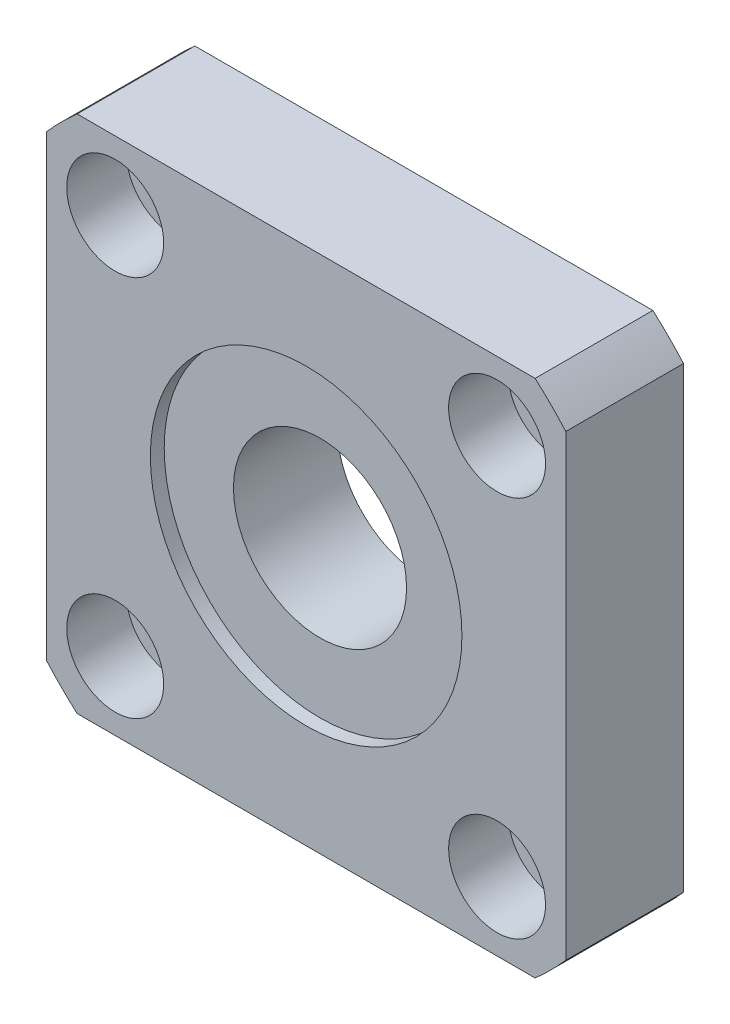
ISO-10303-21;
HEADER;
FILE_DESCRIPTION(('STEP AP214'),'2;1');
FILE_NAME('part.step','',(''),(''),'','','');
FILE_SCHEMA(('AUTOMOTIVE_DESIGN { 1 0 10303 214 1 1 1 1 }'));
ENDSEC;
DATA;
#1=APPLICATION_CONTEXT('core data for automotive mechanical design processes');
#2=APPLICATION_PROTOCOL_DEFINITION('international standard','automotive_design',2000,#1);
#3=PRODUCT_CONTEXT('',#1,'mechanical');
#4=PRODUCT('Part','Part','',(#3));
#5=PRODUCT_RELATED_PRODUCT_CATEGORY('part','',(#4));
#6=PRODUCT_DEFINITION_FORMATION('','',#4);
#7=PRODUCT_DEFINITION_CONTEXT('part definition',#1,'design');
#8=PRODUCT_DEFINITION('design','',#6,#7);
#9=PRODUCT_DEFINITION_SHAPE('','',#8);
#10=(LENGTH_UNIT() NAMED_UNIT(*) SI_UNIT(.MILLI.,.METRE.));
#11=(NAMED_UNIT(*) PLANE_ANGLE_UNIT() SI_UNIT($,.RADIAN.));
#12=(NAMED_UNIT(*) SI_UNIT($,.STERADIAN.) SOLID_ANGLE_UNIT());
#13=UNCERTAINTY_MEASURE_WITH_UNIT(LENGTH_MEASURE(1.E-05),#10,'distance_accuracy_value','');
#14=(GEOMETRIC_REPRESENTATION_CONTEXT(3) GLOBAL_UNCERTAINTY_ASSIGNED_CONTEXT((#13)) GLOBAL_UNIT_ASSIGNED_CONTEXT((#10,
#11,#12)) REPRESENTATION_CONTEXT('',''));
#15=CARTESIAN_POINT('',(0.,0.,0.));
#16=DIRECTION('',(0.,0.,1.));
#17=DIRECTION('',(1.,0.,0.));
#18=AXIS2_PLACEMENT_3D('',#15,#16,#17);
#19=CARTESIAN_POINT('',(0.,0.,17.));
#20=DIRECTION('',(0.,0.,-1.));
#21=DIRECTION('',(-1.,0.,0.));
#22=AXIS2_PLACEMENT_3D('',#19,#20,#21);
#23=CYLINDRICAL_SURFACE('',#22,12.5);
#24=CARTESIAN_POINT('',(0.,0.,0.));
#25=DIRECTION('',(0.,0.,1.));
#26=DIRECTION('',(1.,0.,0.));
#27=AXIS2_PLACEMENT_3D('',#24,#25,#26);
#28=CIRCLE('',#27,12.5);
#29=CARTESIAN_POINT('',(12.5,0.,0.));
#30=VERTEX_POINT('',#29);
#31=EDGE_CURVE('E95',#30,#30,#28,.T.);
#32=ORIENTED_EDGE('',*,*,#31,.F.);
#33=EDGE_LOOP('',(#32));
#34=FACE_BOUND('',#33,.T.);
#35=CARTESIAN_POINT('',(0.,0.,15.));
#36=DIRECTION('',(0.,0.,1.));
#37=DIRECTION('',(1.,0.,0.));
#38=AXIS2_PLACEMENT_3D('',#35,#36,#37);
#39=CIRCLE('',#38,12.5);
#40=CARTESIAN_POINT('',(12.5,0.,15.));
#41=VERTEX_POINT('',#40);
#42=EDGE_CURVE('E18',#41,#41,#39,.T.);
#43=ORIENTED_EDGE('',*,*,#42,.T.);
#44=EDGE_LOOP('',(#43));
#45=FACE_BOUND('',#44,.T.);
#46=ADVANCED_FACE('F14',(#34,#45),#23,.F.);
#47=CARTESIAN_POINT('',(-27.5771644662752,27.5771644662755,0.));
#48=DIRECTION('',(0.,0.,1.));
#49=DIRECTION('',(1.,0.,0.));
#50=AXIS2_PLACEMENT_3D('',#47,#48,#49);
#51=CYLINDRICAL_SURFACE('',#50,5.);
#52=CARTESIAN_POINT('',(-27.5771644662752,27.5771644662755,0.));
#53=DIRECTION('',(0.,0.,1.));
#54=DIRECTION('',(0.,1.,0.));
#55=AXIS2_PLACEMENT_3D('',#52,#53,#54);
#56=CIRCLE('',#55,5.);
#57=CARTESIAN_POINT('',(-27.5771644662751,32.5771644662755,0.));
#58=VERTEX_POINT('',#57);
#59=EDGE_CURVE('E158',#58,#58,#56,.T.);
#60=ORIENTED_EDGE('',*,*,#59,.F.);
#61=EDGE_LOOP('',(#60));
#62=FACE_BOUND('',#61,.T.);
#63=CARTESIAN_POINT('',(-27.5771644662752,27.5771644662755,8.4));
#64=DIRECTION('',(0.,0.,1.));
#65=DIRECTION('',(1.,0.,0.));
#66=AXIS2_PLACEMENT_3D('',#63,#64,#65);
#67=CIRCLE('',#66,5.);
#68=CARTESIAN_POINT('',(-22.5771644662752,27.5771644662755,8.4));
#69=VERTEX_POINT('',#68);
#70=EDGE_CURVE('E164',#69,#69,#67,.F.);
#71=ORIENTED_EDGE('',*,*,#70,.F.);
#72=EDGE_LOOP('',(#71));
#73=FACE_BOUND('',#72,.T.);
#74=ADVANCED_FACE('F206',(#62,#73),#51,.F.);
#75=CARTESIAN_POINT('',(-27.5771644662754,-27.5771644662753,0.));
#76=DIRECTION('',(0.,0.,1.));
#77=DIRECTION('',(1.,0.,0.));
#78=AXIS2_PLACEMENT_3D('',#75,#76,#77);
#79=CYLINDRICAL_SURFACE('',#78,5.);
#80=CARTESIAN_POINT('',(-27.5771644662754,-27.5771644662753,0.));
#81=DIRECTION('',(0.,0.,1.));
#82=DIRECTION('',(-1.,0.,0.));
#83=AXIS2_PLACEMENT_3D('',#80,#81,#82);
#84=CIRCLE('',#83,5.);
#85=CARTESIAN_POINT('',(-32.5771644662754,-27.5771644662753,0.));
#86=VERTEX_POINT('',#85);
#87=EDGE_CURVE('E189',#86,#86,#84,.T.);
#88=ORIENTED_EDGE('',*,*,#87,.F.);
#89=EDGE_LOOP('',(#88));
#90=FACE_BOUND('',#89,.T.);
#91=CARTESIAN_POINT('',(-27.5771644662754,-27.5771644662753,8.4));
#92=DIRECTION('',(0.,0.,1.));
#93=DIRECTION('',(1.,0.,0.));
#94=AXIS2_PLACEMENT_3D('',#91,#92,#93);
#95=CIRCLE('',#94,5.);
#96=CARTESIAN_POINT('',(-22.5771644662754,-27.5771644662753,8.4));
#97=VERTEX_POINT('',#96);
#98=EDGE_CURVE('E160',#97,#97,#95,.F.);
#99=ORIENTED_EDGE('',*,*,#98,.F.);
#100=EDGE_LOOP('',(#99));
#101=FACE_BOUND('',#100,.T.);
#102=ADVANCED_FACE('F288',(#90,#101),#79,.F.);
#103=CARTESIAN_POINT('',(27.5771644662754,-27.5771644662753,0.));
#104=DIRECTION('',(0.,0.,1.));
#105=DIRECTION('',(1.,0.,0.));
#106=AXIS2_PLACEMENT_3D('',#103,#104,#105);
#107=CYLINDRICAL_SURFACE('',#106,5.);
#108=CARTESIAN_POINT('',(27.5771644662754,-27.5771644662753,0.));
#109=DIRECTION('',(0.,0.,1.));
#110=DIRECTION('',(0.,-1.,0.));
#111=AXIS2_PLACEMENT_3D('',#108,#109,#110);
#112=CIRCLE('',#111,5.);
#113=CARTESIAN_POINT('',(27.5771644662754,-32.5771644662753,0.));
#114=VERTEX_POINT('',#113);
#115=EDGE_CURVE('E192',#114,#114,#112,.T.);
#116=ORIENTED_EDGE('',*,*,#115,.F.);
#117=EDGE_LOOP('',(#116));
#118=FACE_BOUND('',#117,.T.);
#119=CARTESIAN_POINT('',(27.5771644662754,-27.5771644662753,8.4));
#120=DIRECTION('',(0.,0.,1.));
#121=DIRECTION('',(1.,0.,0.));
#122=AXIS2_PLACEMENT_3D('',#119,#120,#121);
#123=CIRCLE('',#122,5.);
#124=CARTESIAN_POINT('',(32.5771644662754,-27.5771644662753,8.4));
#125=VERTEX_POINT('',#124);
#126=EDGE_CURVE('E155',#125,#125,#123,.F.);
#127=ORIENTED_EDGE('',*,*,#126,.F.);
#128=EDGE_LOOP('',(#127));
#129=FACE_BOUND('',#128,.T.);
#130=ADVANCED_FACE('F276',(#118,#129),#107,.F.);
#131=CARTESIAN_POINT('',(27.5771644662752,27.5771644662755,0.));
#132=DIRECTION('',(0.,0.,1.));
#133=DIRECTION('',(1.,0.,0.));
#134=AXIS2_PLACEMENT_3D('',#131,#132,#133);
#135=CYLINDRICAL_SURFACE('',#134,5.);
#136=CARTESIAN_POINT('',(27.5771644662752,27.5771644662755,0.));
#137=DIRECTION('',(0.,0.,1.));
#138=DIRECTION('',(1.,0.,0.));
#139=AXIS2_PLACEMENT_3D('',#136,#137,#138);
#140=CIRCLE('',#139,5.);
#141=CARTESIAN_POINT('',(32.5771644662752,27.5771644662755,0.));
#142=VERTEX_POINT('',#141);
#143=EDGE_CURVE('E153',#142,#142,#140,.T.);
#144=ORIENTED_EDGE('',*,*,#143,.F.);
#145=EDGE_LOOP('',(#144));
#146=FACE_BOUND('',#145,.T.);
#147=CARTESIAN_POINT('',(27.5771644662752,27.5771644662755,8.4));
#148=DIRECTION('',(0.,0.,1.));
#149=DIRECTION('',(1.,0.,0.));
#150=AXIS2_PLACEMENT_3D('',#147,#148,#149);
#151=CIRCLE('',#150,5.);
#152=CARTESIAN_POINT('',(32.5771644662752,27.5771644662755,8.4));
#153=VERTEX_POINT('',#152);
#154=EDGE_CURVE('E150',#153,#153,#151,.F.);
#155=ORIENTED_EDGE('',*,*,#154,.F.);
#156=EDGE_LOOP('',(#155));
#157=FACE_BOUND('',#156,.T.);
#158=ADVANCED_FACE('F225',(#146,#157),#135,.F.);
#159=CARTESIAN_POINT('',(0.,0.,17.));
#160=DIRECTION('',(0.,0.,1.));
#161=DIRECTION('',(1.,0.,0.));
#162=AXIS2_PLACEMENT_3D('',#159,#160,#161);
#163=PLANE('',#162);
#164=CARTESIAN_POINT('',(0.,0.,17.));
#165=DIRECTION('',(0.,0.,1.));
#166=DIRECTION('',(1.,0.,0.));
#167=AXIS2_PLACEMENT_3D('',#164,#165,#166);
#168=CIRCLE('',#167,22.5);
#169=CARTESIAN_POINT('',(22.5,0.,17.));
#170=VERTEX_POINT('',#169);
#171=EDGE_CURVE('E213',#170,#170,#168,.T.);
#172=ORIENTED_EDGE('',*,*,#171,.F.);
#173=EDGE_LOOP('',(#172));
#174=FACE_BOUND('',#173,.T.);
#175=CARTESIAN_POINT('',(-27.5771644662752,27.5771644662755,17.));
#176=DIRECTION('',(0.,0.,1.));
#177=DIRECTION('',(0.,1.,0.));
#178=AXIS2_PLACEMENT_3D('',#175,#176,#177);
#179=CIRCLE('',#178,7.);
#180=CARTESIAN_POINT('',(-27.5771644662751,34.5771644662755,17.));
#181=VERTEX_POINT('',#180);
#182=EDGE_CURVE('E173',#181,#181,#179,.T.);
#183=ORIENTED_EDGE('',*,*,#182,.F.);
#184=EDGE_LOOP('',(#183));
#185=FACE_BOUND('',#184,.T.);
#186=CARTESIAN_POINT('',(-27.5771644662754,-27.5771644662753,17.));
#187=DIRECTION('',(0.,0.,1.));
#188=DIRECTION('',(-1.,0.,0.));
#189=AXIS2_PLACEMENT_3D('',#186,#187,#188);
#190=CIRCLE('',#189,7.);
#191=CARTESIAN_POINT('',(-34.5771644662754,-27.5771644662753,17.));
#192=VERTEX_POINT('',#191);
#193=EDGE_CURVE('E166',#192,#192,#190,.T.);
#194=ORIENTED_EDGE('',*,*,#193,.F.);
#195=EDGE_LOOP('',(#194));
#196=FACE_BOUND('',#195,.T.);
#197=CARTESIAN_POINT('',(27.5771644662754,-27.5771644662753,17.));
#198=DIRECTION('',(0.,0.,1.));
#199=DIRECTION('',(0.,-1.,0.));
#200=AXIS2_PLACEMENT_3D('',#197,#198,#199);
#201=CIRCLE('',#200,7.);
#202=CARTESIAN_POINT('',(27.5771644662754,-34.5771644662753,17.));
#203=VERTEX_POINT('',#202);
#204=EDGE_CURVE('E162',#203,#203,#201,.T.);
#205=ORIENTED_EDGE('',*,*,#204,.F.);
#206=EDGE_LOOP('',(#205));
#207=FACE_BOUND('',#206,.T.);
#208=CARTESIAN_POINT('',(27.5771644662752,27.5771644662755,17.));
#209=DIRECTION('',(0.,0.,1.));
#210=DIRECTION('',(1.,0.,0.));
#211=AXIS2_PLACEMENT_3D('',#208,#209,#210);
#212=CIRCLE('',#211,7.);
#213=CARTESIAN_POINT('',(34.5771644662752,27.5771644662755,17.));
#214=VERTEX_POINT('',#213);
#215=EDGE_CURVE('E195',#214,#214,#212,.T.);
#216=ORIENTED_EDGE('',*,*,#215,.F.);
#217=EDGE_LOOP('',(#216));
#218=FACE_BOUND('',#217,.T.);
#219=CARTESIAN_POINT('',(0.,0.,17.));
#220=DIRECTION('',(0.,0.,1.));
#221=DIRECTION('',(1.,0.,0.));
#222=AXIS2_PLACEMENT_3D('',#219,#220,#221);
#223=CIRCLE('',#222,50.);
#224=CARTESIAN_POINT('',(37.5,33.0718913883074,17.));
#225=VERTEX_POINT('',#224);
#226=CARTESIAN_POINT('',(33.0718913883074,37.5,17.));
#227=VERTEX_POINT('',#226);
#228=EDGE_CURVE('E120',#225,#227,#223,.T.);
#229=ORIENTED_EDGE('',*,*,#228,.T.);
#230=DIRECTION('',(-1.,0.,0.));
#231=VECTOR('',#230,1.);
#232=CARTESIAN_POINT('',(33.0718913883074,37.5,17.));
#233=LINE('',#232,#231);
#234=CARTESIAN_POINT('',(-33.0718913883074,37.5,17.));
#235=VERTEX_POINT('',#234);
#236=EDGE_CURVE('E87',#227,#235,#233,.T.);
#237=ORIENTED_EDGE('',*,*,#236,.T.);
#238=CARTESIAN_POINT('',(0.,0.,17.));
#239=DIRECTION('',(0.,0.,-1.));
#240=DIRECTION('',(-1.,0.,0.));
#241=AXIS2_PLACEMENT_3D('',#238,#239,#240);
#242=CIRCLE('',#241,50.);
#243=CARTESIAN_POINT('',(-37.5,33.0718913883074,17.));
#244=VERTEX_POINT('',#243);
#245=EDGE_CURVE('E123',#244,#235,#242,.T.);
#246=ORIENTED_EDGE('',*,*,#245,.F.);
#247=DIRECTION('',(0.,-1.,0.));
#248=VECTOR('',#247,1.);
#249=CARTESIAN_POINT('',(-37.5,33.0718913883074,17.));
#250=LINE('',#249,#248);
#251=CARTESIAN_POINT('',(-37.5,-33.0718913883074,17.));
#252=VERTEX_POINT('',#251);
#253=EDGE_CURVE('E126',#244,#252,#250,.T.);
#254=ORIENTED_EDGE('',*,*,#253,.T.);
#255=CARTESIAN_POINT('',(0.,0.,17.));
#256=DIRECTION('',(0.,0.,1.));
#257=DIRECTION('',(1.,0.,0.));
#258=AXIS2_PLACEMENT_3D('',#255,#256,#257);
#259=CIRCLE('',#258,50.);
#260=CARTESIAN_POINT('',(-33.0718913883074,-37.5,17.));
#261=VERTEX_POINT('',#260);
#262=EDGE_CURVE('E129',#252,#261,#259,.T.);
#263=ORIENTED_EDGE('',*,*,#262,.T.);
#264=DIRECTION('',(-1.,0.,0.));
#265=VECTOR('',#264,1.);
#266=CARTESIAN_POINT('',(33.0718913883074,-37.5,17.));
#267=LINE('',#266,#265);
#268=CARTESIAN_POINT('',(33.0718913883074,-37.5,17.));
#269=VERTEX_POINT('',#268);
#270=EDGE_CURVE('E132',#269,#261,#267,.T.);
#271=ORIENTED_EDGE('',*,*,#270,.F.);
#272=CARTESIAN_POINT('',(0.,0.,17.));
#273=DIRECTION('',(0.,0.,-1.));
#274=DIRECTION('',(-1.,0.,0.));
#275=AXIS2_PLACEMENT_3D('',#272,#273,#274);
#276=CIRCLE('',#275,50.);
#277=CARTESIAN_POINT('',(37.5,-33.0718913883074,17.));
#278=VERTEX_POINT('',#277);
#279=EDGE_CURVE('E135',#278,#269,#276,.T.);
#280=ORIENTED_EDGE('',*,*,#279,.F.);
#281=DIRECTION('',(0.,-1.,0.));
#282=VECTOR('',#281,1.);
#283=CARTESIAN_POINT('',(37.5,33.0718913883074,17.));
#284=LINE('',#283,#282);
#285=EDGE_CURVE('E137',#225,#278,#284,.T.);
#286=ORIENTED_EDGE('',*,*,#285,.F.);
#287=EDGE_LOOP('',(#229,#237,#246,#254,#263,#271,#280,#286));
#288=FACE_BOUND('',#287,.T.);
#289=ADVANCED_FACE('F222',(#174,#185,#196,#207,#218,#288),#163,.T.);
#290=CARTESIAN_POINT('',(0.,0.,0.));
#291=DIRECTION('',(0.,0.,1.));
#292=DIRECTION('',(1.,0.,0.));
#293=AXIS2_PLACEMENT_3D('',#290,#291,#292);
#294=PLANE('',#293);
#295=ORIENTED_EDGE('',*,*,#59,.T.);
#296=EDGE_LOOP('',(#295));
#297=FACE_BOUND('',#296,.T.);
#298=ORIENTED_EDGE('',*,*,#87,.T.);
#299=EDGE_LOOP('',(#298));
#300=FACE_BOUND('',#299,.T.);
#301=ORIENTED_EDGE('',*,*,#115,.T.);
#302=EDGE_LOOP('',(#301));
#303=FACE_BOUND('',#302,.T.);
#304=ORIENTED_EDGE('',*,*,#143,.T.);
#305=EDGE_LOOP('',(#304));
#306=FACE_BOUND('',#305,.T.);
#307=CARTESIAN_POINT('',(0.,0.,0.));
#308=DIRECTION('',(0.,0.,1.));
#309=DIRECTION('',(1.,0.,0.));
#310=AXIS2_PLACEMENT_3D('',#307,#308,#309);
#311=CIRCLE('',#310,50.);
#312=CARTESIAN_POINT('',(37.5,33.0718913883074,0.));
#313=VERTEX_POINT('',#312);
#314=CARTESIAN_POINT('',(33.0718913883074,37.5,0.));
#315=VERTEX_POINT('',#314);
#316=EDGE_CURVE('E91',#313,#315,#311,.T.);
#317=ORIENTED_EDGE('',*,*,#316,.F.);
#318=DIRECTION('',(0.,-1.,0.));
#319=VECTOR('',#318,1.);
#320=CARTESIAN_POINT('',(37.5,33.0718913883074,0.));
#321=LINE('',#320,#319);
#322=CARTESIAN_POINT('',(37.5,-33.0718913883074,0.));
#323=VERTEX_POINT('',#322);
#324=EDGE_CURVE('E118',#313,#323,#321,.T.);
#325=ORIENTED_EDGE('',*,*,#324,.T.);
#326=CARTESIAN_POINT('',(0.,0.,0.));
#327=DIRECTION('',(0.,0.,-1.));
#328=DIRECTION('',(-1.,0.,0.));
#329=AXIS2_PLACEMENT_3D('',#326,#327,#328);
#330=CIRCLE('',#329,50.);
#331=CARTESIAN_POINT('',(33.0718913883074,-37.5,0.));
#332=VERTEX_POINT('',#331);
#333=EDGE_CURVE('E115',#323,#332,#330,.T.);
#334=ORIENTED_EDGE('',*,*,#333,.T.);
#335=DIRECTION('',(-1.,0.,0.));
#336=VECTOR('',#335,1.);
#337=CARTESIAN_POINT('',(33.0718913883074,-37.5,0.));
#338=LINE('',#337,#336);
#339=CARTESIAN_POINT('',(-33.0718913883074,-37.5,0.));
#340=VERTEX_POINT('',#339);
#341=EDGE_CURVE('E112',#332,#340,#338,.T.);
#342=ORIENTED_EDGE('',*,*,#341,.T.);
#343=CARTESIAN_POINT('',(0.,0.,0.));
#344=DIRECTION('',(0.,0.,1.));
#345=DIRECTION('',(1.,0.,0.));
#346=AXIS2_PLACEMENT_3D('',#343,#344,#345);
#347=CIRCLE('',#346,50.);
#348=CARTESIAN_POINT('',(-37.5,-33.0718913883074,0.));
#349=VERTEX_POINT('',#348);
#350=EDGE_CURVE('E109',#349,#340,#347,.T.);
#351=ORIENTED_EDGE('',*,*,#350,.F.);
#352=DIRECTION('',(0.,-1.,0.));
#353=VECTOR('',#352,1.);
#354=CARTESIAN_POINT('',(-37.5,33.0718913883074,0.));
#355=LINE('',#354,#353);
#356=CARTESIAN_POINT('',(-37.5,33.0718913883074,0.));
#357=VERTEX_POINT('',#356);
#358=EDGE_CURVE('E103',#357,#349,#355,.T.);
#359=ORIENTED_EDGE('',*,*,#358,.F.);
#360=CARTESIAN_POINT('',(0.,0.,0.));
#361=DIRECTION('',(0.,0.,-1.));
#362=DIRECTION('',(-1.,0.,0.));
#363=AXIS2_PLACEMENT_3D('',#360,#361,#362);
#364=CIRCLE('',#363,50.);
#365=CARTESIAN_POINT('',(-33.0718913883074,37.5,0.));
#366=VERTEX_POINT('',#365);
#367=EDGE_CURVE('E101',#357,#366,#364,.T.);
#368=ORIENTED_EDGE('',*,*,#367,.T.);
#369=DIRECTION('',(-1.,0.,0.));
#370=VECTOR('',#369,1.);
#371=CARTESIAN_POINT('',(33.0718913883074,37.5,0.));
#372=LINE('',#371,#370);
#373=EDGE_CURVE('E84',#315,#366,#372,.T.);
#374=ORIENTED_EDGE('',*,*,#373,.F.);
#375=EDGE_LOOP('',(#317,#325,#334,#342,#351,#359,#368,#374));
#376=FACE_BOUND('',#375,.T.);
#377=ORIENTED_EDGE('',*,*,#31,.T.);
#378=EDGE_LOOP('',(#377));
#379=FACE_BOUND('',#378,.T.);
#380=ADVANCED_FACE('F97',(#297,#300,#303,#306,#376,#379),#294,.F.);
#381=CARTESIAN_POINT('',(0.,0.,17.));
#382=DIRECTION('',(0.,0.,-1.));
#383=DIRECTION('',(-1.,0.,0.));
#384=AXIS2_PLACEMENT_3D('',#381,#382,#383);
#385=CYLINDRICAL_SURFACE('',#384,50.);
#386=DIRECTION('',(0.,0.,-1.));
#387=VECTOR('',#386,1.);
#388=CARTESIAN_POINT('',(33.0718913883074,37.5,17.));
#389=LINE('',#388,#387);
#390=EDGE_CURVE('E9',#227,#315,#389,.T.);
#391=ORIENTED_EDGE('',*,*,#390,.F.);
#392=ORIENTED_EDGE('',*,*,#228,.F.);
#393=DIRECTION('',(0.,0.,-1.));
#394=VECTOR('',#393,1.);
#395=CARTESIAN_POINT('',(37.5,33.0718913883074,17.));
#396=LINE('',#395,#394);
#397=EDGE_CURVE('E31',#225,#313,#396,.T.);
#398=ORIENTED_EDGE('',*,*,#397,.T.);
#399=ORIENTED_EDGE('',*,*,#316,.T.);
#400=EDGE_LOOP('',(#391,#392,#398,#399));
#401=FACE_BOUND('',#400,.T.);
#402=ADVANCED_FACE('F92',(#401),#385,.T.);
#403=CARTESIAN_POINT('',(33.0718913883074,37.5,17.));
#404=DIRECTION('',(0.,-1.,0.));
#405=DIRECTION('',(0.,0.,-1.));
#406=AXIS2_PLACEMENT_3D('',#403,#404,#405);
#407=PLANE('',#406);
#408=DIRECTION('',(0.,0.,-1.));
#409=VECTOR('',#408,1.);
#410=CARTESIAN_POINT('',(-33.0718913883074,37.5,17.));
#411=LINE('',#410,#409);
#412=EDGE_CURVE('E23',#235,#366,#411,.T.);
#413=ORIENTED_EDGE('',*,*,#412,.F.);
#414=ORIENTED_EDGE('',*,*,#236,.F.);
#415=ORIENTED_EDGE('',*,*,#390,.T.);
#416=ORIENTED_EDGE('',*,*,#373,.T.);
#417=EDGE_LOOP('',(#413,#414,#415,#416));
#418=FACE_BOUND('',#417,.T.);
#419=ADVANCED_FACE('F16',(#418),#407,.F.);
#420=CARTESIAN_POINT('',(0.,0.,17.));
#421=DIRECTION('',(0.,0.,-1.));
#422=DIRECTION('',(-1.,0.,0.));
#423=AXIS2_PLACEMENT_3D('',#420,#421,#422);
#424=CYLINDRICAL_SURFACE('',#423,50.);
#425=DIRECTION('',(0.,0.,-1.));
#426=VECTOR('',#425,1.);
#427=CARTESIAN_POINT('',(-37.5,33.0718913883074,17.));
#428=LINE('',#427,#426);
#429=EDGE_CURVE('E147',#244,#357,#428,.T.);
#430=ORIENTED_EDGE('',*,*,#429,.F.);
#431=ORIENTED_EDGE('',*,*,#245,.T.);
#432=ORIENTED_EDGE('',*,*,#412,.T.);
#433=ORIENTED_EDGE('',*,*,#367,.F.);
#434=EDGE_LOOP('',(#430,#431,#432,#433));
#435=FACE_BOUND('',#434,.T.);
#436=ADVANCED_FACE('F251',(#435),#424,.T.);
#437=CARTESIAN_POINT('',(-37.5,33.0718913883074,17.));
#438=DIRECTION('',(1.,0.,0.));
#439=DIRECTION('',(0.,0.,-1.));
#440=AXIS2_PLACEMENT_3D('',#437,#438,#439);
#441=PLANE('',#440);
#442=DIRECTION('',(0.,0.,-1.));
#443=VECTOR('',#442,1.);
#444=CARTESIAN_POINT('',(-37.5,-33.0718913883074,17.));
#445=LINE('',#444,#443);
#446=EDGE_CURVE('E145',#252,#349,#445,.T.);
#447=ORIENTED_EDGE('',*,*,#446,.F.);
#448=ORIENTED_EDGE('',*,*,#253,.F.);
#449=ORIENTED_EDGE('',*,*,#429,.T.);
#450=ORIENTED_EDGE('',*,*,#358,.T.);
#451=EDGE_LOOP('',(#447,#448,#449,#450));
#452=FACE_BOUND('',#451,.T.);
#453=ADVANCED_FACE('F249',(#452),#441,.F.);
#454=CARTESIAN_POINT('',(0.,0.,17.));
#455=DIRECTION('',(0.,0.,-1.));
#456=DIRECTION('',(-1.,0.,0.));
#457=AXIS2_PLACEMENT_3D('',#454,#455,#456);
#458=CYLINDRICAL_SURFACE('',#457,50.);
#459=DIRECTION('',(0.,0.,-1.));
#460=VECTOR('',#459,1.);
#461=CARTESIAN_POINT('',(-33.0718913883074,-37.5,17.));
#462=LINE('',#461,#460);
#463=EDGE_CURVE('E143',#261,#340,#462,.T.);
#464=ORIENTED_EDGE('',*,*,#463,.F.);
#465=ORIENTED_EDGE('',*,*,#262,.F.);
#466=ORIENTED_EDGE('',*,*,#446,.T.);
#467=ORIENTED_EDGE('',*,*,#350,.T.);
#468=EDGE_LOOP('',(#464,#465,#466,#467));
#469=FACE_BOUND('',#468,.T.);
#470=ADVANCED_FACE('F246',(#469),#458,.T.);
#471=CARTESIAN_POINT('',(33.0718913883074,-37.5,17.));
#472=DIRECTION('',(0.,-1.,0.));
#473=DIRECTION('',(0.,0.,-1.));
#474=AXIS2_PLACEMENT_3D('',#471,#472,#473);
#475=PLANE('',#474);
#476=DIRECTION('',(0.,0.,-1.));
#477=VECTOR('',#476,1.);
#478=CARTESIAN_POINT('',(33.0718913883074,-37.5,17.));
#479=LINE('',#478,#477);
#480=EDGE_CURVE('E141',#269,#332,#479,.T.);
#481=ORIENTED_EDGE('',*,*,#480,.F.);
#482=ORIENTED_EDGE('',*,*,#270,.T.);
#483=ORIENTED_EDGE('',*,*,#463,.T.);
#484=ORIENTED_EDGE('',*,*,#341,.F.);
#485=EDGE_LOOP('',(#481,#482,#483,#484));
#486=FACE_BOUND('',#485,.T.);
#487=ADVANCED_FACE('F243',(#486),#475,.T.);
#488=CARTESIAN_POINT('',(0.,0.,17.));
#489=DIRECTION('',(0.,0.,-1.));
#490=DIRECTION('',(-1.,0.,0.));
#491=AXIS2_PLACEMENT_3D('',#488,#489,#490);
#492=CYLINDRICAL_SURFACE('',#491,50.);
#493=DIRECTION('',(0.,0.,-1.));
#494=VECTOR('',#493,1.);
#495=CARTESIAN_POINT('',(37.5,-33.0718913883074,17.));
#496=LINE('',#495,#494);
#497=EDGE_CURVE('E39',#278,#323,#496,.T.);
#498=ORIENTED_EDGE('',*,*,#497,.F.);
#499=ORIENTED_EDGE('',*,*,#279,.T.);
#500=ORIENTED_EDGE('',*,*,#480,.T.);
#501=ORIENTED_EDGE('',*,*,#333,.F.);
#502=EDGE_LOOP('',(#498,#499,#500,#501));
#503=FACE_BOUND('',#502,.T.);
#504=ADVANCED_FACE('F239',(#503),#492,.T.);
#505=CARTESIAN_POINT('',(37.5,33.0718913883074,17.));
#506=DIRECTION('',(1.,0.,0.));
#507=DIRECTION('',(0.,0.,-1.));
#508=AXIS2_PLACEMENT_3D('',#505,#506,#507);
#509=PLANE('',#508);
#510=ORIENTED_EDGE('',*,*,#285,.T.);
#511=ORIENTED_EDGE('',*,*,#497,.T.);
#512=ORIENTED_EDGE('',*,*,#324,.F.);
#513=ORIENTED_EDGE('',*,*,#397,.F.);
#514=EDGE_LOOP('',(#510,#511,#512,#513));
#515=FACE_BOUND('',#514,.T.);
#516=ADVANCED_FACE('F238',(#515),#509,.T.);
#517=CARTESIAN_POINT('',(27.5771644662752,27.5771644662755,8.4));
#518=DIRECTION('',(0.,0.,1.));
#519=DIRECTION('',(1.,0.,0.));
#520=AXIS2_PLACEMENT_3D('',#517,#518,#519);
#521=PLANE('',#520);
#522=CARTESIAN_POINT('',(27.5771644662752,27.5771644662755,8.4));
#523=DIRECTION('',(0.,0.,1.));
#524=DIRECTION('',(1.,0.,0.));
#525=AXIS2_PLACEMENT_3D('',#522,#523,#524);
#526=CIRCLE('',#525,7.);
#527=CARTESIAN_POINT('',(34.5771644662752,27.5771644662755,8.4));
#528=VERTEX_POINT('',#527);
#529=EDGE_CURVE('E154',#528,#528,#526,.T.);
#530=ORIENTED_EDGE('',*,*,#529,.T.);
#531=EDGE_LOOP('',(#530));
#532=FACE_BOUND('',#531,.T.);
#533=ORIENTED_EDGE('',*,*,#154,.T.);
#534=EDGE_LOOP('',(#533));
#535=FACE_BOUND('',#534,.T.);
#536=ADVANCED_FACE('F268',(#532,#535),#521,.T.);
#537=CARTESIAN_POINT('',(27.5771644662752,27.5771644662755,8.4));
#538=DIRECTION('',(0.,0.,1.));
#539=DIRECTION('',(1.,0.,0.));
#540=AXIS2_PLACEMENT_3D('',#537,#538,#539);
#541=CYLINDRICAL_SURFACE('',#540,7.);
#542=ORIENTED_EDGE('',*,*,#529,.F.);
#543=EDGE_LOOP('',(#542));
#544=FACE_BOUND('',#543,.T.);
#545=ORIENTED_EDGE('',*,*,#215,.T.);
#546=EDGE_LOOP('',(#545));
#547=FACE_BOUND('',#546,.T.);
#548=ADVANCED_FACE('F278',(#544,#547),#541,.F.);
#549=CARTESIAN_POINT('',(27.5771644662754,-27.5771644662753,8.4));
#550=DIRECTION('',(0.,0.,1.));
#551=DIRECTION('',(0.,-1.,0.));
#552=AXIS2_PLACEMENT_3D('',#549,#550,#551);
#553=PLANE('',#552);
#554=CARTESIAN_POINT('',(27.5771644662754,-27.5771644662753,8.4));
#555=DIRECTION('',(0.,0.,1.));
#556=DIRECTION('',(0.,-1.,0.));
#557=AXIS2_PLACEMENT_3D('',#554,#555,#556);
#558=CIRCLE('',#557,7.);
#559=CARTESIAN_POINT('',(27.5771644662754,-34.5771644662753,8.4));
#560=VERTEX_POINT('',#559);
#561=EDGE_CURVE('E159',#560,#560,#558,.T.);
#562=ORIENTED_EDGE('',*,*,#561,.T.);
#563=EDGE_LOOP('',(#562));
#564=FACE_BOUND('',#563,.T.);
#565=ORIENTED_EDGE('',*,*,#126,.T.);
#566=EDGE_LOOP('',(#565));
#567=FACE_BOUND('',#566,.T.);
#568=ADVANCED_FACE('F281',(#564,#567),#553,.T.);
#569=CARTESIAN_POINT('',(27.5771644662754,-27.5771644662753,8.4));
#570=DIRECTION('',(0.,0.,1.));
#571=DIRECTION('',(1.,0.,0.));
#572=AXIS2_PLACEMENT_3D('',#569,#570,#571);
#573=CYLINDRICAL_SURFACE('',#572,7.);
#574=ORIENTED_EDGE('',*,*,#561,.F.);
#575=EDGE_LOOP('',(#574));
#576=FACE_BOUND('',#575,.T.);
#577=ORIENTED_EDGE('',*,*,#204,.T.);
#578=EDGE_LOOP('',(#577));
#579=FACE_BOUND('',#578,.T.);
#580=ADVANCED_FACE('F296',(#576,#579),#573,.F.);
#581=CARTESIAN_POINT('',(-27.5771644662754,-27.5771644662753,8.4));
#582=DIRECTION('',(0.,0.,1.));
#583=DIRECTION('',(-1.,0.,0.));
#584=AXIS2_PLACEMENT_3D('',#581,#582,#583);
#585=PLANE('',#584);
#586=CARTESIAN_POINT('',(-27.5771644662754,-27.5771644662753,8.4));
#587=DIRECTION('',(0.,0.,1.));
#588=DIRECTION('',(-1.,0.,0.));
#589=AXIS2_PLACEMENT_3D('',#586,#587,#588);
#590=CIRCLE('',#589,7.);
#591=CARTESIAN_POINT('',(-34.5771644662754,-27.5771644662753,8.4));
#592=VERTEX_POINT('',#591);
#593=EDGE_CURVE('E163',#592,#592,#590,.T.);
#594=ORIENTED_EDGE('',*,*,#593,.T.);
#595=EDGE_LOOP('',(#594));
#596=FACE_BOUND('',#595,.T.);
#597=ORIENTED_EDGE('',*,*,#98,.T.);
#598=EDGE_LOOP('',(#597));
#599=FACE_BOUND('',#598,.T.);
#600=ADVANCED_FACE('F299',(#596,#599),#585,.T.);
#601=CARTESIAN_POINT('',(-27.5771644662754,-27.5771644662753,8.4));
#602=DIRECTION('',(0.,0.,1.));
#603=DIRECTION('',(1.,0.,0.));
#604=AXIS2_PLACEMENT_3D('',#601,#602,#603);
#605=CYLINDRICAL_SURFACE('',#604,7.);
#606=ORIENTED_EDGE('',*,*,#593,.F.);
#607=EDGE_LOOP('',(#606));
#608=FACE_BOUND('',#607,.T.);
#609=ORIENTED_EDGE('',*,*,#193,.T.);
#610=EDGE_LOOP('',(#609));
#611=FACE_BOUND('',#610,.T.);
#612=ADVANCED_FACE('F304',(#608,#611),#605,.F.);
#613=CARTESIAN_POINT('',(-27.5771644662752,27.5771644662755,8.4));
#614=DIRECTION('',(0.,0.,1.));
#615=DIRECTION('',(0.,1.,0.));
#616=AXIS2_PLACEMENT_3D('',#613,#614,#615);
#617=PLANE('',#616);
#618=CARTESIAN_POINT('',(-27.5771644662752,27.5771644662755,8.4));
#619=DIRECTION('',(0.,0.,1.));
#620=DIRECTION('',(0.,1.,0.));
#621=AXIS2_PLACEMENT_3D('',#618,#619,#620);
#622=CIRCLE('',#621,7.);
#623=CARTESIAN_POINT('',(-27.5771644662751,34.5771644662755,8.4));
#624=VERTEX_POINT('',#623);
#625=EDGE_CURVE('E167',#624,#624,#622,.T.);
#626=ORIENTED_EDGE('',*,*,#625,.T.);
#627=EDGE_LOOP('',(#626));
#628=FACE_BOUND('',#627,.T.);
#629=ORIENTED_EDGE('',*,*,#70,.T.);
#630=EDGE_LOOP('',(#629));
#631=FACE_BOUND('',#630,.T.);
#632=ADVANCED_FACE('F307',(#628,#631),#617,.T.);
#633=CARTESIAN_POINT('',(-27.5771644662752,27.5771644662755,8.4));
#634=DIRECTION('',(0.,0.,1.));
#635=DIRECTION('',(1.,0.,0.));
#636=AXIS2_PLACEMENT_3D('',#633,#634,#635);
#637=CYLINDRICAL_SURFACE('',#636,7.);
#638=ORIENTED_EDGE('',*,*,#625,.F.);
#639=EDGE_LOOP('',(#638));
#640=FACE_BOUND('',#639,.T.);
#641=ORIENTED_EDGE('',*,*,#182,.T.);
#642=EDGE_LOOP('',(#641));
#643=FACE_BOUND('',#642,.T.);
#644=ADVANCED_FACE('F312',(#640,#643),#637,.F.);
#645=CARTESIAN_POINT('',(0.,0.,15.));
#646=DIRECTION('',(0.,0.,1.));
#647=DIRECTION('',(1.,0.,0.));
#648=AXIS2_PLACEMENT_3D('',#645,#646,#647);
#649=CYLINDRICAL_SURFACE('',#648,22.5);
#650=CARTESIAN_POINT('',(0.,0.,15.));
#651=DIRECTION('',(0.,0.,1.));
#652=DIRECTION('',(1.,0.,0.));
#653=AXIS2_PLACEMENT_3D('',#650,#651,#652);
#654=CIRCLE('',#653,22.5);
#655=CARTESIAN_POINT('',(22.5,0.,15.));
#656=VERTEX_POINT('',#655);
#657=EDGE_CURVE('E211',#656,#656,#654,.T.);
#658=ORIENTED_EDGE('',*,*,#657,.F.);
#659=EDGE_LOOP('',(#658));
#660=FACE_BOUND('',#659,.T.);
#661=ORIENTED_EDGE('',*,*,#171,.T.);
#662=EDGE_LOOP('',(#661));
#663=FACE_BOUND('',#662,.T.);
#664=ADVANCED_FACE('F220',(#660,#663),#649,.F.);
#665=CARTESIAN_POINT('',(0.,0.,15.));
#666=DIRECTION('',(0.,0.,1.));
#667=DIRECTION('',(1.,0.,0.));
#668=AXIS2_PLACEMENT_3D('',#665,#666,#667);
#669=PLANE('',#668);
#670=ORIENTED_EDGE('',*,*,#42,.F.);
#671=EDGE_LOOP('',(#670));
#672=FACE_BOUND('',#671,.T.);
#673=ORIENTED_EDGE('',*,*,#657,.T.);
#674=EDGE_LOOP('',(#673));
#675=FACE_BOUND('',#674,.T.);
#676=ADVANCED_FACE('F316',(#672,#675),#669,.T.);
#677=CLOSED_SHELL('',(#46,#74,#102,#130,#158,#289,#380,#402,#419,#436,#453,#470,#487,#504,#516,
#536,#548,#568,#580,#600,#612,#632,#644,#664,#676));
#678=MANIFOLD_SOLID_BREP('B1',#677);
#679=ADVANCED_BREP_SHAPE_REPRESENTATION('',(#18,#678),#14);
#680=SHAPE_DEFINITION_REPRESENTATION(#9,#679);
ENDSEC;
END-ISO-10303-21;
